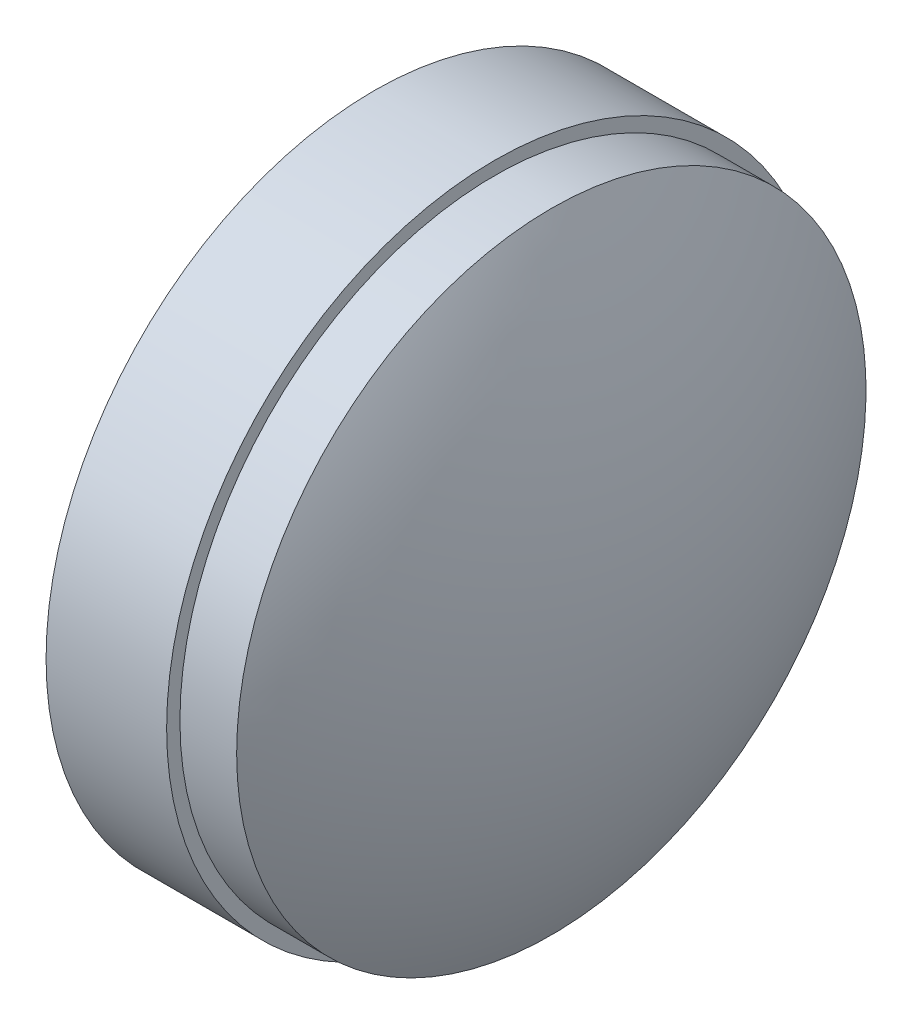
from build123d import *


with BuildPart() as part:
    # Sketch1 → Revolve1 (revolve)
    with BuildSketch(Plane.XY):
        with BuildLine():
            Line((3.4, 9.25), (0, 9.25))
            ThreePointArc((0, 9.25), (0.749273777, 4.651948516), (1, 0))
            Line((1, 0), (7.27, 0))
            ThreePointArc((7.27, 0), (6.693510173, 4.580352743), (5, 8.875))
            Line((5, 8.875), (3.4, 8.875))
            Line((3.4, 8.875), (3.4, 9.25))
        make_face()
    revolve(axis=Axis((-5.427540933, 0, 0), (1, 0, 0)))


solid = part.part
